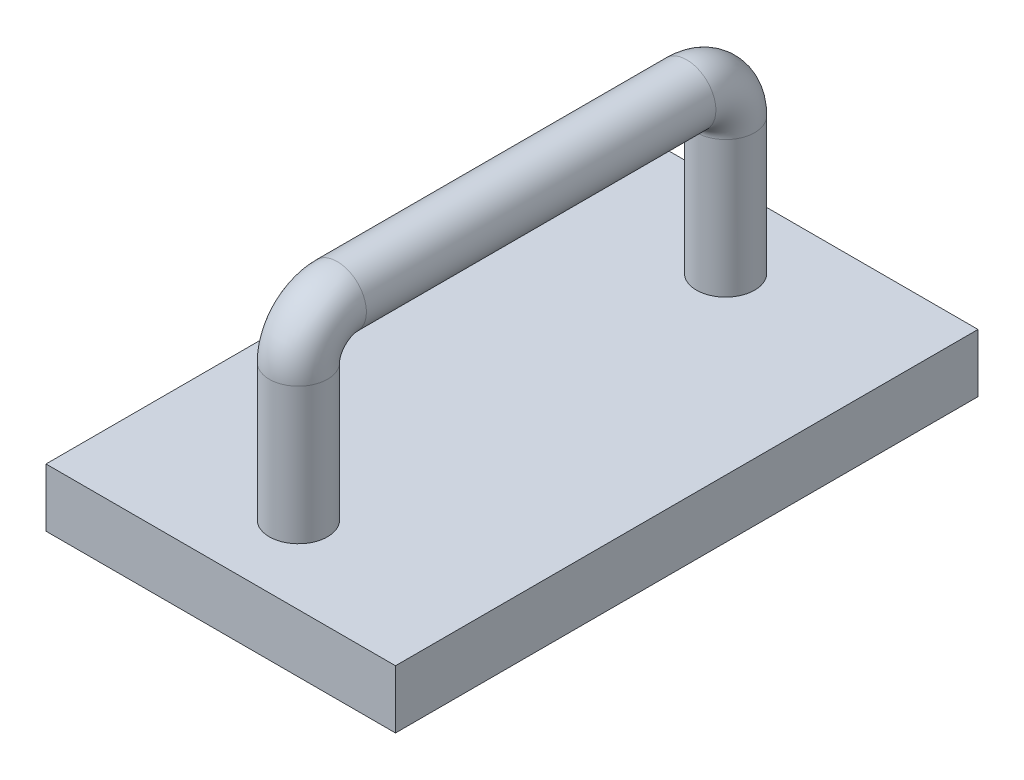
ISO-10303-21;
HEADER;
FILE_DESCRIPTION(('STEP AP214'),'2;1');
FILE_NAME('part.step','',(''),(''),'','','');
FILE_SCHEMA(('AUTOMOTIVE_DESIGN { 1 0 10303 214 1 1 1 1 }'));
ENDSEC;
DATA;
#1=APPLICATION_CONTEXT('core data for automotive mechanical design processes');
#2=APPLICATION_PROTOCOL_DEFINITION('international standard','automotive_design',2000,#1);
#3=PRODUCT_CONTEXT('',#1,'mechanical');
#4=PRODUCT('Part','Part','',(#3));
#5=PRODUCT_RELATED_PRODUCT_CATEGORY('part','',(#4));
#6=PRODUCT_DEFINITION_FORMATION('','',#4);
#7=PRODUCT_DEFINITION_CONTEXT('part definition',#1,'design');
#8=PRODUCT_DEFINITION('design','',#6,#7);
#9=PRODUCT_DEFINITION_SHAPE('','',#8);
#10=(LENGTH_UNIT() NAMED_UNIT(*) SI_UNIT(.MILLI.,.METRE.));
#11=(NAMED_UNIT(*) PLANE_ANGLE_UNIT() SI_UNIT($,.RADIAN.));
#12=(NAMED_UNIT(*) SI_UNIT($,.STERADIAN.) SOLID_ANGLE_UNIT());
#13=UNCERTAINTY_MEASURE_WITH_UNIT(LENGTH_MEASURE(1.E-05),#10,'distance_accuracy_value','');
#14=(GEOMETRIC_REPRESENTATION_CONTEXT(3) GLOBAL_UNCERTAINTY_ASSIGNED_CONTEXT((#13)) GLOBAL_UNIT_ASSIGNED_CONTEXT((#10,
#11,#12)) REPRESENTATION_CONTEXT('',''));
#15=CARTESIAN_POINT('',(0.,0.,0.));
#16=DIRECTION('',(0.,0.,1.));
#17=DIRECTION('',(1.,0.,0.));
#18=AXIS2_PLACEMENT_3D('',#15,#16,#17);
#19=CARTESIAN_POINT('',(-45.,15.,-75.));
#20=DIRECTION('',(1.,0.,0.));
#21=DIRECTION('',(0.,0.,-1.));
#22=AXIS2_PLACEMENT_3D('',#19,#20,#21);
#23=PLANE('',#22);
#24=DIRECTION('',(0.,0.,1.));
#25=VECTOR('',#24,1.);
#26=CARTESIAN_POINT('',(-45.,0.,-75.));
#27=LINE('',#26,#25);
#28=CARTESIAN_POINT('',(-45.,0.,-75.));
#29=VERTEX_POINT('',#28);
#30=CARTESIAN_POINT('',(-45.,0.,75.));
#31=VERTEX_POINT('',#30);
#32=EDGE_CURVE('E99',#29,#31,#27,.T.);
#33=ORIENTED_EDGE('',*,*,#32,.T.);
#34=DIRECTION('',(0.,-1.,0.));
#35=VECTOR('',#34,1.);
#36=CARTESIAN_POINT('',(-45.,15.,75.));
#37=LINE('',#36,#35);
#38=CARTESIAN_POINT('',(-45.,15.,75.));
#39=VERTEX_POINT('',#38);
#40=EDGE_CURVE('E90',#39,#31,#37,.T.);
#41=ORIENTED_EDGE('',*,*,#40,.F.);
#42=DIRECTION('',(0.,0.,1.));
#43=VECTOR('',#42,1.);
#44=CARTESIAN_POINT('',(-45.,15.,-75.));
#45=LINE('',#44,#43);
#46=CARTESIAN_POINT('',(-45.,15.,-75.));
#47=VERTEX_POINT('',#46);
#48=EDGE_CURVE('E84',#47,#39,#45,.T.);
#49=ORIENTED_EDGE('',*,*,#48,.F.);
#50=DIRECTION('',(0.,-1.,0.));
#51=VECTOR('',#50,1.);
#52=CARTESIAN_POINT('',(-45.,15.,-75.));
#53=LINE('',#52,#51);
#54=EDGE_CURVE('E95',#47,#29,#53,.T.);
#55=ORIENTED_EDGE('',*,*,#54,.T.);
#56=EDGE_LOOP('',(#33,#41,#49,#55));
#57=FACE_BOUND('',#56,.T.);
#58=ADVANCED_FACE('F31',(#57),#23,.F.);
#59=CARTESIAN_POINT('',(-45.,15.,75.));
#60=DIRECTION('',(0.,0.,-1.));
#61=DIRECTION('',(-1.,0.,0.));
#62=AXIS2_PLACEMENT_3D('',#59,#60,#61);
#63=PLANE('',#62);
#64=DIRECTION('',(1.,0.,0.));
#65=VECTOR('',#64,1.);
#66=CARTESIAN_POINT('',(-45.,0.,75.));
#67=LINE('',#66,#65);
#68=CARTESIAN_POINT('',(45.,0.,75.));
#69=VERTEX_POINT('',#68);
#70=EDGE_CURVE('E89',#31,#69,#67,.T.);
#71=ORIENTED_EDGE('',*,*,#70,.T.);
#72=DIRECTION('',(0.,-1.,0.));
#73=VECTOR('',#72,1.);
#74=CARTESIAN_POINT('',(45.,15.,75.));
#75=LINE('',#74,#73);
#76=CARTESIAN_POINT('',(45.,15.,75.));
#77=VERTEX_POINT('',#76);
#78=EDGE_CURVE('E87',#77,#69,#75,.T.);
#79=ORIENTED_EDGE('',*,*,#78,.F.);
#80=DIRECTION('',(1.,0.,0.));
#81=VECTOR('',#80,1.);
#82=CARTESIAN_POINT('',(-45.,15.,75.));
#83=LINE('',#82,#81);
#84=EDGE_CURVE('E79',#39,#77,#83,.T.);
#85=ORIENTED_EDGE('',*,*,#84,.F.);
#86=ORIENTED_EDGE('',*,*,#40,.T.);
#87=EDGE_LOOP('',(#71,#79,#85,#86));
#88=FACE_BOUND('',#87,.T.);
#89=ADVANCED_FACE('F88',(#88),#63,.F.);
#90=CARTESIAN_POINT('',(45.,15.,-75.));
#91=DIRECTION('',(-1.,0.,0.));
#92=DIRECTION('',(0.,0.,1.));
#93=AXIS2_PLACEMENT_3D('',#90,#91,#92);
#94=PLANE('',#93);
#95=DIRECTION('',(0.,0.,-1.));
#96=VECTOR('',#95,1.);
#97=CARTESIAN_POINT('',(45.,0.,-75.));
#98=LINE('',#97,#96);
#99=CARTESIAN_POINT('',(45.,0.,-75.));
#100=VERTEX_POINT('',#99);
#101=EDGE_CURVE('E65',#69,#100,#98,.T.);
#102=ORIENTED_EDGE('',*,*,#101,.T.);
#103=DIRECTION('',(0.,-1.,0.));
#104=VECTOR('',#103,1.);
#105=CARTESIAN_POINT('',(45.,15.,-75.));
#106=LINE('',#105,#104);
#107=CARTESIAN_POINT('',(45.,15.,-75.));
#108=VERTEX_POINT('',#107);
#109=EDGE_CURVE('E91',#108,#100,#106,.T.);
#110=ORIENTED_EDGE('',*,*,#109,.F.);
#111=DIRECTION('',(0.,0.,-1.));
#112=VECTOR('',#111,1.);
#113=CARTESIAN_POINT('',(45.,15.,-75.));
#114=LINE('',#113,#112);
#115=EDGE_CURVE('E82',#77,#108,#114,.T.);
#116=ORIENTED_EDGE('',*,*,#115,.F.);
#117=ORIENTED_EDGE('',*,*,#78,.T.);
#118=EDGE_LOOP('',(#102,#110,#116,#117));
#119=FACE_BOUND('',#118,.T.);
#120=ADVANCED_FACE('F93',(#119),#94,.F.);
#121=CARTESIAN_POINT('',(-45.,15.,-75.));
#122=DIRECTION('',(0.,0.,1.));
#123=DIRECTION('',(1.,0.,0.));
#124=AXIS2_PLACEMENT_3D('',#121,#122,#123);
#125=PLANE('',#124);
#126=DIRECTION('',(-1.,0.,0.));
#127=VECTOR('',#126,1.);
#128=CARTESIAN_POINT('',(-45.,0.,-75.));
#129=LINE('',#128,#127);
#130=EDGE_CURVE('E71',#100,#29,#129,.T.);
#131=ORIENTED_EDGE('',*,*,#130,.T.);
#132=ORIENTED_EDGE('',*,*,#54,.F.);
#133=DIRECTION('',(-1.,0.,0.));
#134=VECTOR('',#133,1.);
#135=CARTESIAN_POINT('',(-45.,15.,-75.));
#136=LINE('',#135,#134);
#137=EDGE_CURVE('E48',#108,#47,#136,.T.);
#138=ORIENTED_EDGE('',*,*,#137,.F.);
#139=ORIENTED_EDGE('',*,*,#109,.T.);
#140=EDGE_LOOP('',(#131,#132,#138,#139));
#141=FACE_BOUND('',#140,.T.);
#142=ADVANCED_FACE('F115',(#141),#125,.F.);
#143=CARTESIAN_POINT('',(-45.,15.,75.));
#144=DIRECTION('',(0.,1.,0.));
#145=DIRECTION('',(0.,0.,1.));
#146=AXIS2_PLACEMENT_3D('',#143,#144,#145);
#147=PLANE('',#146);
#148=CARTESIAN_POINT('',(0.,15.,-55.));
#149=DIRECTION('',(0.,1.,0.));
#150=DIRECTION('',(0.,0.,1.));
#151=AXIS2_PLACEMENT_3D('',#148,#149,#150);
#152=CIRCLE('',#151,7.5);
#153=CARTESIAN_POINT('',(0.,15.,-47.5));
#154=VERTEX_POINT('',#153);
#155=EDGE_CURVE('E11',#154,#154,#152,.T.);
#156=ORIENTED_EDGE('',*,*,#155,.F.);
#157=EDGE_LOOP('',(#156));
#158=FACE_BOUND('',#157,.T.);
#159=CARTESIAN_POINT('',(0.,15.,55.));
#160=DIRECTION('',(0.,1.,0.));
#161=DIRECTION('',(0.,0.,1.));
#162=AXIS2_PLACEMENT_3D('',#159,#160,#161);
#163=CIRCLE('',#162,7.5);
#164=CARTESIAN_POINT('',(0.,15.,62.5));
#165=VERTEX_POINT('',#164);
#166=EDGE_CURVE('E34',#165,#165,#163,.T.);
#167=ORIENTED_EDGE('',*,*,#166,.F.);
#168=EDGE_LOOP('',(#167));
#169=FACE_BOUND('',#168,.T.);
#170=ORIENTED_EDGE('',*,*,#48,.T.);
#171=ORIENTED_EDGE('',*,*,#84,.T.);
#172=ORIENTED_EDGE('',*,*,#115,.T.);
#173=ORIENTED_EDGE('',*,*,#137,.T.);
#174=EDGE_LOOP('',(#170,#171,#172,#173));
#175=FACE_BOUND('',#174,.T.);
#176=ADVANCED_FACE('F80',(#158,#169,#175),#147,.T.);
#177=CARTESIAN_POINT('',(-45.,0.,75.));
#178=DIRECTION('',(0.,1.,0.));
#179=DIRECTION('',(0.,0.,1.));
#180=AXIS2_PLACEMENT_3D('',#177,#178,#179);
#181=PLANE('',#180);
#182=ORIENTED_EDGE('',*,*,#32,.F.);
#183=ORIENTED_EDGE('',*,*,#130,.F.);
#184=ORIENTED_EDGE('',*,*,#101,.F.);
#185=ORIENTED_EDGE('',*,*,#70,.F.);
#186=EDGE_LOOP('',(#182,#183,#184,#185));
#187=FACE_BOUND('',#186,.T.);
#188=ADVANCED_FACE('F114',(#187),#181,.F.);
#189=CARTESIAN_POINT('',(0.,50.1364986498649,55.));
#190=DIRECTION('',(0.,-1.,0.));
#191=DIRECTION('',(0.,0.,-1.));
#192=AXIS2_PLACEMENT_3D('',#189,#190,#191);
#193=CYLINDRICAL_SURFACE('',#192,7.5);
#194=ORIENTED_EDGE('',*,*,#166,.T.);
#195=EDGE_LOOP('',(#194));
#196=FACE_BOUND('',#195,.T.);
#197=CARTESIAN_POINT('',(0.,50.1364986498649,55.));
#198=DIRECTION('',(0.,-1.,0.));
#199=DIRECTION('',(0.,0.,-1.));
#200=AXIS2_PLACEMENT_3D('',#197,#198,#199);
#201=CIRCLE('',#200,7.5);
#202=CARTESIAN_POINT('',(0.,50.1364986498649,62.5));
#203=VERTEX_POINT('',#202);
#204=EDGE_CURVE('E102',#203,#203,#201,.T.);
#205=ORIENTED_EDGE('',*,*,#204,.T.);
#206=EDGE_LOOP('',(#205));
#207=FACE_BOUND('',#206,.T.);
#208=ADVANCED_FACE('F110',(#196,#207),#193,.T.);
#209=CARTESIAN_POINT('',(0.,50.136498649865,45.));
#210=DIRECTION('',(1.,0.,0.));
#211=DIRECTION('',(0.,0.,-1.));
#212=AXIS2_PLACEMENT_3D('',#209,#210,#211);
#213=TOROIDAL_SURFACE('',#212,10.,7.5);
#214=CARTESIAN_POINT('',(0.,60.136498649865,44.9999999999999));
#215=DIRECTION('',(0.,0.,1.));
#216=DIRECTION('',(0.,-1.,0.));
#217=AXIS2_PLACEMENT_3D('',#214,#215,#216);
#218=CIRCLE('',#217,7.5);
#219=CARTESIAN_POINT('',(0.,67.636498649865,44.9999999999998));
#220=VERTEX_POINT('',#219);
#221=EDGE_CURVE('E136',#220,#220,#218,.T.);
#222=CARTESIAN_POINT('',(0.,50.136498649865,45.));
#223=DIRECTION('',(1.,0.,0.));
#224=DIRECTION('',(0.,0.,-1.));
#225=AXIS2_PLACEMENT_3D('',#222,#223,#224);
#226=CIRCLE('',#225,17.5);
#227=EDGE_CURVE('',#220,#203,#226,.T.);
#228=ORIENTED_EDGE('',*,*,#221,.T.);
#229=ORIENTED_EDGE('',*,*,#204,.F.);
#230=ORIENTED_EDGE('',*,*,#227,.T.);
#231=ORIENTED_EDGE('',*,*,#227,.F.);
#232=EDGE_LOOP('',(#228,#230,#229,#231));
#233=FACE_BOUND('',#232,.T.);
#234=ADVANCED_FACE('F161',(#233),#213,.T.);
#235=CARTESIAN_POINT('',(0.,60.136498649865,-44.9999999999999));
#236=DIRECTION('',(0.,0.,1.));
#237=DIRECTION('',(1.,0.,0.));
#238=AXIS2_PLACEMENT_3D('',#235,#236,#237);
#239=CYLINDRICAL_SURFACE('',#238,7.5);
#240=CARTESIAN_POINT('',(0.,60.136498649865,-44.9999999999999));
#241=DIRECTION('',(0.,0.,1.));
#242=DIRECTION('',(0.,-1.,0.));
#243=AXIS2_PLACEMENT_3D('',#240,#241,#242);
#244=CIRCLE('',#243,7.5);
#245=CARTESIAN_POINT('',(0.,67.636498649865,-44.9999999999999));
#246=VERTEX_POINT('',#245);
#247=EDGE_CURVE('E139',#246,#246,#244,.T.);
#248=ORIENTED_EDGE('',*,*,#247,.T.);
#249=EDGE_LOOP('',(#248));
#250=FACE_BOUND('',#249,.T.);
#251=ORIENTED_EDGE('',*,*,#221,.F.);
#252=EDGE_LOOP('',(#251));
#253=FACE_BOUND('',#252,.T.);
#254=ADVANCED_FACE('F156',(#250,#253),#239,.T.);
#255=CARTESIAN_POINT('',(0.,50.136498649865,-45.));
#256=DIRECTION('',(1.,0.,0.));
#257=DIRECTION('',(0.,0.,-1.));
#258=AXIS2_PLACEMENT_3D('',#255,#256,#257);
#259=TOROIDAL_SURFACE('',#258,10.,7.5);
#260=CARTESIAN_POINT('',(0.,50.136498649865,-55.));
#261=DIRECTION('',(0.,1.,0.));
#262=DIRECTION('',(0.,0.,1.));
#263=AXIS2_PLACEMENT_3D('',#260,#261,#262);
#264=CIRCLE('',#263,7.5);
#265=CARTESIAN_POINT('',(0.,50.136498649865,-62.5));
#266=VERTEX_POINT('',#265);
#267=EDGE_CURVE('E141',#266,#266,#264,.T.);
#268=CARTESIAN_POINT('',(0.,50.136498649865,-45.));
#269=DIRECTION('',(1.,0.,0.));
#270=DIRECTION('',(0.,0.,-1.));
#271=AXIS2_PLACEMENT_3D('',#268,#269,#270);
#272=CIRCLE('',#271,17.5);
#273=EDGE_CURVE('',#266,#246,#272,.T.);
#274=ORIENTED_EDGE('',*,*,#267,.T.);
#275=ORIENTED_EDGE('',*,*,#247,.F.);
#276=ORIENTED_EDGE('',*,*,#273,.T.);
#277=ORIENTED_EDGE('',*,*,#273,.F.);
#278=EDGE_LOOP('',(#274,#276,#275,#277));
#279=FACE_BOUND('',#278,.T.);
#280=ADVANCED_FACE('F146',(#279),#259,.T.);
#281=CARTESIAN_POINT('',(0.,50.136498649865,-55.));
#282=DIRECTION('',(0.,-1.,0.));
#283=DIRECTION('',(0.,0.,-1.));
#284=AXIS2_PLACEMENT_3D('',#281,#282,#283);
#285=CYLINDRICAL_SURFACE('',#284,7.5);
#286=ORIENTED_EDGE('',*,*,#267,.F.);
#287=EDGE_LOOP('',(#286));
#288=FACE_BOUND('',#287,.T.);
#289=ORIENTED_EDGE('',*,*,#155,.T.);
#290=EDGE_LOOP('',(#289));
#291=FACE_BOUND('',#290,.T.);
#292=ADVANCED_FACE('F149',(#288,#291),#285,.T.);
#293=CLOSED_SHELL('',(#58,#89,#120,#142,#176,#188,#208,#234,#254,#280,#292));
#294=MANIFOLD_SOLID_BREP('B2',#293);
#295=ADVANCED_BREP_SHAPE_REPRESENTATION('',(#18,#294),#14);
#296=SHAPE_DEFINITION_REPRESENTATION(#9,#295);
ENDSEC;
END-ISO-10303-21;
